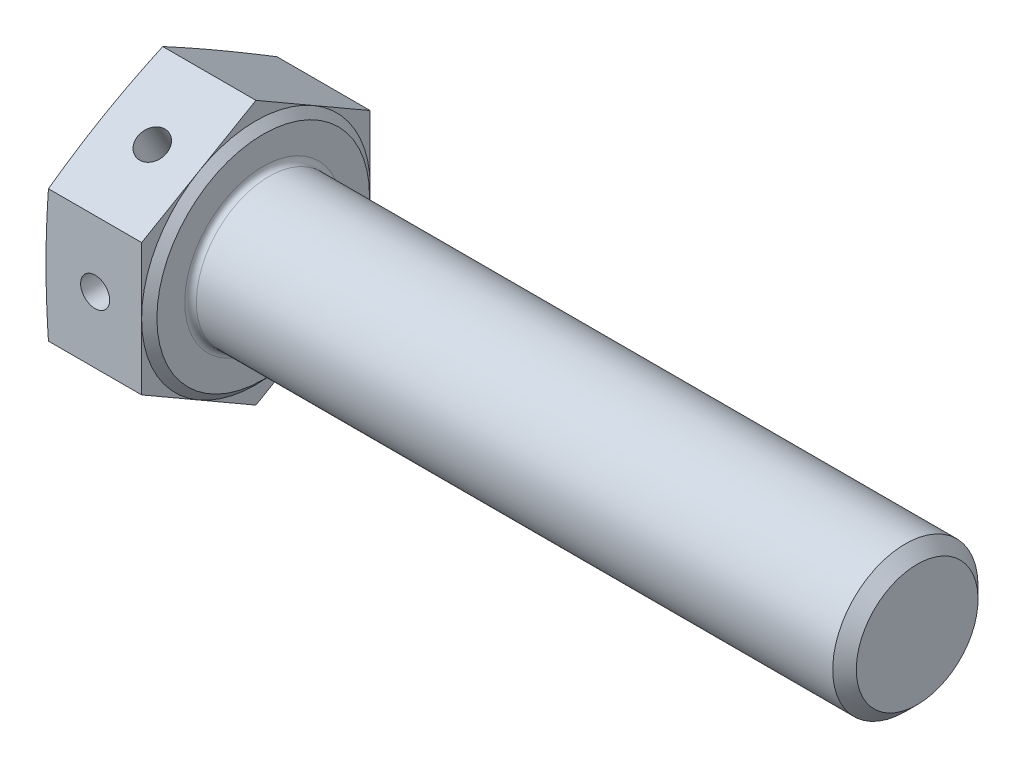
ISO-10303-21;
HEADER;
FILE_DESCRIPTION(('STEP AP214'),'2;1');
FILE_NAME('part.step','',(''),(''),'','','');
FILE_SCHEMA(('AUTOMOTIVE_DESIGN { 1 0 10303 214 1 1 1 1 }'));
ENDSEC;
DATA;
#1=APPLICATION_CONTEXT('core data for automotive mechanical design processes');
#2=APPLICATION_PROTOCOL_DEFINITION('international standard','automotive_design',2000,#1);
#3=PRODUCT_CONTEXT('',#1,'mechanical');
#4=PRODUCT('Part','Part','',(#3));
#5=PRODUCT_RELATED_PRODUCT_CATEGORY('part','',(#4));
#6=PRODUCT_DEFINITION_FORMATION('','',#4);
#7=PRODUCT_DEFINITION_CONTEXT('part definition',#1,'design');
#8=PRODUCT_DEFINITION('design','',#6,#7);
#9=PRODUCT_DEFINITION_SHAPE('','',#8);
#10=(LENGTH_UNIT() NAMED_UNIT(*) SI_UNIT(.MILLI.,.METRE.));
#11=(NAMED_UNIT(*) PLANE_ANGLE_UNIT() SI_UNIT($,.RADIAN.));
#12=(NAMED_UNIT(*) SI_UNIT($,.STERADIAN.) SOLID_ANGLE_UNIT());
#13=UNCERTAINTY_MEASURE_WITH_UNIT(LENGTH_MEASURE(1.E-05),#10,'distance_accuracy_value','');
#14=(GEOMETRIC_REPRESENTATION_CONTEXT(3) GLOBAL_UNCERTAINTY_ASSIGNED_CONTEXT((#13)) GLOBAL_UNIT_ASSIGNED_CONTEXT((#10,
#11,#12)) REPRESENTATION_CONTEXT('',''));
#15=CARTESIAN_POINT('',(0.,0.,0.));
#16=DIRECTION('',(0.,0.,1.));
#17=DIRECTION('',(1.,0.,0.));
#18=AXIS2_PLACEMENT_3D('',#15,#16,#17);
#19=CARTESIAN_POINT('',(3.38,0.,-7.865));
#20=DIRECTION('',(0.,0.,1.));
#21=DIRECTION('',(1.,0.,0.));
#22=AXIS2_PLACEMENT_3D('',#19,#20,#21);
#23=CYLINDRICAL_SURFACE('',#22,0.999999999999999);
#24=CARTESIAN_POINT('',(3.38,0.,7.865));
#25=DIRECTION('',(0.,0.,1.));
#26=DIRECTION('',(1.,0.,0.));
#27=AXIS2_PLACEMENT_3D('',#24,#25,#26);
#28=CIRCLE('',#27,0.999999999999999);
#29=CARTESIAN_POINT('',(4.38,0.,7.865));
#30=VERTEX_POINT('',#29);
#31=EDGE_CURVE('E584',#30,#30,#28,.T.);
#32=ORIENTED_EDGE('',*,*,#31,.T.);
#33=EDGE_LOOP('',(#32));
#34=FACE_BOUND('',#33,.T.);
#35=CARTESIAN_POINT('',(3.38,0.,0.));
#36=DIRECTION('',(0.,-0.866025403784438,0.500000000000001));
#37=DIRECTION('',(0.,0.500000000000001,0.866025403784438));
#38=AXIS2_PLACEMENT_3D('',#35,#36,#37);
#39=ELLIPSE('',#38,1.99999999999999,0.999999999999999);
#40=CARTESIAN_POINT('',(2.38,0.,0.));
#41=VERTEX_POINT('',#40);
#42=CARTESIAN_POINT('',(4.38,0.,0.));
#43=VERTEX_POINT('',#42);
#44=EDGE_CURVE('E46',#41,#43,#39,.F.);
#45=ORIENTED_EDGE('',*,*,#44,.T.);
#46=CARTESIAN_POINT('',(3.38,0.,0.));
#47=DIRECTION('',(0.,0.500000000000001,0.866025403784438));
#48=DIRECTION('',(0.,-0.866025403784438,0.500000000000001));
#49=AXIS2_PLACEMENT_3D('',#46,#47,#48);
#50=ELLIPSE('',#49,1.15470053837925,0.999999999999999);
#51=EDGE_CURVE('E11',#43,#41,#50,.F.);
#52=ORIENTED_EDGE('',*,*,#51,.T.);
#53=EDGE_LOOP('',(#45,#52));
#54=FACE_BOUND('',#53,.T.);
#55=ADVANCED_FACE('F32',(#34,#54),#23,.F.);
#56=CARTESIAN_POINT('',(7.08,0.,0.));
#57=DIRECTION('',(-1.,0.,0.));
#58=DIRECTION('',(0.,-1.,0.));
#59=AXIS2_PLACEMENT_3D('',#56,#57,#58);
#60=PLANE('',#59);
#61=CARTESIAN_POINT('',(7.08,0.,0.));
#62=DIRECTION('',(-1.,0.,0.));
#63=DIRECTION('',(0.,-1.,0.));
#64=AXIS2_PLACEMENT_3D('',#61,#62,#63);
#65=CIRCLE('',#64,5.4);
#66=CARTESIAN_POINT('',(7.08,-5.4,0.));
#67=VERTEX_POINT('',#66);
#68=EDGE_CURVE('E137',#67,#67,#65,.T.);
#69=ORIENTED_EDGE('',*,*,#68,.T.);
#70=EDGE_LOOP('',(#69));
#71=FACE_BOUND('',#70,.T.);
#72=CARTESIAN_POINT('',(7.08,0.,0.));
#73=DIRECTION('',(-1.,0.,0.));
#74=DIRECTION('',(0.,-1.,0.));
#75=AXIS2_PLACEMENT_3D('',#72,#73,#74);
#76=CIRCLE('',#75,7.315);
#77=CARTESIAN_POINT('',(7.08,-7.315,0.));
#78=VERTEX_POINT('',#77);
#79=EDGE_CURVE('E284',#78,#78,#76,.T.);
#80=ORIENTED_EDGE('',*,*,#79,.F.);
#81=EDGE_LOOP('',(#80));
#82=FACE_BOUND('',#81,.T.);
#83=ADVANCED_FACE('F239',(#71,#82),#60,.F.);
#84=CARTESIAN_POINT('',(6.58,-13.6225796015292,-7.865));
#85=DIRECTION('',(1.,0.,0.));
#86=DIRECTION('',(0.,0.,-1.));
#87=AXIS2_PLACEMENT_3D('',#84,#85,#86);
#88=PLANE('',#87);
#89=DIRECTION('',(0.,-0.5,-0.866025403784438));
#90=VECTOR('',#89,1.);
#91=CARTESIAN_POINT('',(6.58,-4.54085986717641,7.865));
#92=LINE('',#91,#90);
#93=CARTESIAN_POINT('',(6.58,-4.54085986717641,7.865));
#94=VERTEX_POINT('',#93);
#95=CARTESIAN_POINT('',(6.58,-6.81128980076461,3.9325));
#96=VERTEX_POINT('',#95);
#97=EDGE_CURVE('E197',#94,#96,#92,.T.);
#98=ORIENTED_EDGE('',*,*,#97,.T.);
#99=CARTESIAN_POINT('',(6.58,0.,0.));
#100=DIRECTION('',(-1.,0.,0.));
#101=DIRECTION('',(0.,-1.,0.));
#102=AXIS2_PLACEMENT_3D('',#99,#100,#101);
#103=CIRCLE('',#102,7.865);
#104=CARTESIAN_POINT('',(6.58,0.,7.865));
#105=VERTEX_POINT('',#104);
#106=EDGE_CURVE('E54',#96,#105,#103,.T.);
#107=ORIENTED_EDGE('',*,*,#106,.T.);
#108=DIRECTION('',(0.,-1.,0.));
#109=VECTOR('',#108,1.);
#110=CARTESIAN_POINT('',(6.58,4.54085986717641,7.865));
#111=LINE('',#110,#109);
#112=EDGE_CURVE('E180',#105,#94,#111,.T.);
#113=ORIENTED_EDGE('',*,*,#112,.T.);
#114=EDGE_LOOP('',(#98,#107,#113));
#115=FACE_BOUND('',#114,.T.);
#116=ADVANCED_FACE('F245',(#115),#88,.T.);
#117=CARTESIAN_POINT('',(6.58,4.54085986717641,7.865));
#118=VERTEX_POINT('',#117);
#119=EDGE_CURVE('E177',#118,#105,#111,.T.);
#120=ORIENTED_EDGE('',*,*,#119,.T.);
#121=CARTESIAN_POINT('',(6.58,6.81128980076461,3.9325));
#122=VERTEX_POINT('',#121);
#123=EDGE_CURVE('E153',#105,#122,#103,.T.);
#124=ORIENTED_EDGE('',*,*,#123,.T.);
#125=DIRECTION('',(0.,-0.5,0.866025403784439));
#126=VECTOR('',#125,1.);
#127=CARTESIAN_POINT('',(6.58,9.08171973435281,0.));
#128=LINE('',#127,#126);
#129=EDGE_CURVE('E184',#122,#118,#128,.T.);
#130=ORIENTED_EDGE('',*,*,#129,.T.);
#131=EDGE_LOOP('',(#120,#124,#130));
#132=FACE_BOUND('',#131,.T.);
#133=ADVANCED_FACE('F341',(#132),#88,.T.);
#134=CARTESIAN_POINT('',(6.58,9.08171973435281,0.));
#135=VERTEX_POINT('',#134);
#136=EDGE_CURVE('E181',#135,#122,#128,.T.);
#137=ORIENTED_EDGE('',*,*,#136,.T.);
#138=CARTESIAN_POINT('',(6.58,6.81128980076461,-3.9325));
#139=VERTEX_POINT('',#138);
#140=EDGE_CURVE('E346',#122,#139,#103,.T.);
#141=ORIENTED_EDGE('',*,*,#140,.T.);
#142=DIRECTION('',(0.,0.5,0.866025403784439));
#143=VECTOR('',#142,1.);
#144=CARTESIAN_POINT('',(6.58,4.54085986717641,-7.865));
#145=LINE('',#144,#143);
#146=EDGE_CURVE('E188',#139,#135,#145,.T.);
#147=ORIENTED_EDGE('',*,*,#146,.T.);
#148=EDGE_LOOP('',(#137,#141,#147));
#149=FACE_BOUND('',#148,.T.);
#150=ADVANCED_FACE('F345',(#149),#88,.T.);
#151=CARTESIAN_POINT('',(6.58,4.54085986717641,-7.865));
#152=VERTEX_POINT('',#151);
#153=EDGE_CURVE('E185',#152,#139,#145,.T.);
#154=ORIENTED_EDGE('',*,*,#153,.T.);
#155=CARTESIAN_POINT('',(6.58,0.,-7.865));
#156=VERTEX_POINT('',#155);
#157=EDGE_CURVE('E405',#139,#156,#103,.T.);
#158=ORIENTED_EDGE('',*,*,#157,.T.);
#159=DIRECTION('',(0.,1.,0.));
#160=VECTOR('',#159,1.);
#161=CARTESIAN_POINT('',(6.58,-4.54085986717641,-7.865));
#162=LINE('',#161,#160);
#163=EDGE_CURVE('E192',#156,#152,#162,.T.);
#164=ORIENTED_EDGE('',*,*,#163,.T.);
#165=EDGE_LOOP('',(#154,#158,#164));
#166=FACE_BOUND('',#165,.T.);
#167=ADVANCED_FACE('F398',(#166),#88,.T.);
#168=CARTESIAN_POINT('',(6.58,-4.54085986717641,-7.865));
#169=VERTEX_POINT('',#168);
#170=EDGE_CURVE('E189',#169,#156,#162,.T.);
#171=ORIENTED_EDGE('',*,*,#170,.T.);
#172=CARTESIAN_POINT('',(6.58,-6.81128980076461,-3.9325));
#173=VERTEX_POINT('',#172);
#174=EDGE_CURVE('E403',#156,#173,#103,.T.);
#175=ORIENTED_EDGE('',*,*,#174,.T.);
#176=DIRECTION('',(0.,0.5,-0.866025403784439));
#177=VECTOR('',#176,1.);
#178=CARTESIAN_POINT('',(6.58,-9.08171973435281,0.));
#179=LINE('',#178,#177);
#180=EDGE_CURVE('E196',#173,#169,#179,.T.);
#181=ORIENTED_EDGE('',*,*,#180,.T.);
#182=EDGE_LOOP('',(#171,#175,#181));
#183=FACE_BOUND('',#182,.T.);
#184=ADVANCED_FACE('F393',(#183),#88,.T.);
#185=CARTESIAN_POINT('',(6.58,-9.08171973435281,0.));
#186=VERTEX_POINT('',#185);
#187=EDGE_CURVE('E193',#186,#173,#179,.T.);
#188=ORIENTED_EDGE('',*,*,#187,.T.);
#189=EDGE_CURVE('E292',#173,#96,#103,.T.);
#190=ORIENTED_EDGE('',*,*,#189,.T.);
#191=EDGE_CURVE('E200',#96,#186,#92,.T.);
#192=ORIENTED_EDGE('',*,*,#191,.T.);
#193=EDGE_LOOP('',(#188,#190,#192));
#194=FACE_BOUND('',#193,.T.);
#195=ADVANCED_FACE('F234',(#194),#88,.T.);
#196=CARTESIAN_POINT('',(6.58,-4.54085986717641,7.865));
#197=DIRECTION('',(0.,0.866025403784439,-0.5));
#198=DIRECTION('',(0.,0.5,0.866025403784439));
#199=AXIS2_PLACEMENT_3D('',#196,#197,#198);
#200=PLANE('',#199);
#201=CARTESIAN_POINT('',(0.168092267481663,-9.08183520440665,-0.000199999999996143));
#202=CARTESIAN_POINT('',(0.141966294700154,-8.89279242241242,0.327231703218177));
#203=CARTESIAN_POINT('',(0.118290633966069,-8.70365739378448,0.654823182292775));
#204=CARTESIAN_POINT('',(0.0767449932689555,-8.32520947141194,1.31031421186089));
#205=CARTESIAN_POINT('',(0.0588756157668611,-8.13589656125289,1.63821379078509));
#206=CARTESIAN_POINT('',(0.029873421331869,-7.7574000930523,2.29378890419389));
#207=CARTESIAN_POINT('',(0.0187313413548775,-7.56821671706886,2.62146412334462));
#208=CARTESIAN_POINT('',(0.00379481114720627,-7.18978549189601,3.27692623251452));
#209=CARTESIAN_POINT('',(0.,-7.00053764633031,3.60471311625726));
#210=CARTESIAN_POINT('',(0.,-6.62204195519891,4.26028688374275));
#211=CARTESIAN_POINT('',(0.0037948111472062,-6.43279410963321,4.58807376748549));
#212=CARTESIAN_POINT('',(0.0187313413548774,-6.05436288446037,5.24353587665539));
#213=CARTESIAN_POINT('',(0.0298734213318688,-5.86517950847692,5.57121109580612));
#214=CARTESIAN_POINT('',(0.0588756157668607,-5.48668304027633,6.22678620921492));
#215=CARTESIAN_POINT('',(0.0767449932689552,-5.29737013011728,6.55468578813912));
#216=CARTESIAN_POINT('',(0.118290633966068,-4.91892220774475,7.21017681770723));
#217=CARTESIAN_POINT('',(0.141966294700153,-4.7297871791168,7.53776829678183));
#218=CARTESIAN_POINT('',(0.168092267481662,-4.54074439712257,7.8652));
#219=B_SPLINE_CURVE_WITH_KNOTS('',3,(#201,#202,#203,#204,#205,#206,#207,#208,#209,#210,#211,
#212,#213,#214,#215,#216,#217,#218),.UNSPECIFIED.,.F.,.F.,(4,2,2,2,2,2,2,2,4),(0.,
1.13697631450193,2.27407056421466,3.40959551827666,4.54506469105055,5.68053386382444,
6.81605881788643,7.95315306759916,9.09012938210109),.UNSPECIFIED.);
#220=CARTESIAN_POINT('',(0.168076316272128,-9.08171973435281,0.));
#221=VERTEX_POINT('',#220);
#222=CARTESIAN_POINT('',(0.,-6.81128980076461,3.9325));
#223=VERTEX_POINT('',#222);
#224=EDGE_CURVE('E356',#221,#223,#219,.T.);
#225=ORIENTED_EDGE('',*,*,#224,.F.);
#226=DIRECTION('',(-1.,0.,0.));
#227=VECTOR('',#226,1.);
#228=CARTESIAN_POINT('',(6.58,-9.08171973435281,0.));
#229=LINE('',#228,#227);
#230=EDGE_CURVE('E158',#186,#221,#229,.T.);
#231=ORIENTED_EDGE('',*,*,#230,.F.);
#232=ORIENTED_EDGE('',*,*,#191,.F.);
#233=ORIENTED_EDGE('',*,*,#97,.F.);
#234=DIRECTION('',(-1.,0.,0.));
#235=VECTOR('',#234,1.);
#236=CARTESIAN_POINT('',(6.58,-4.54085986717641,7.865));
#237=LINE('',#236,#235);
#238=CARTESIAN_POINT('',(0.168076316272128,-4.5408598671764,7.865));
#239=VERTEX_POINT('',#238);
#240=EDGE_CURVE('E174',#94,#239,#237,.T.);
#241=ORIENTED_EDGE('',*,*,#240,.T.);
#242=EDGE_CURVE('E333',#223,#239,#219,.T.);
#243=ORIENTED_EDGE('',*,*,#242,.F.);
#244=EDGE_LOOP('',(#225,#231,#232,#233,#241,#243));
#245=FACE_BOUND('',#244,.T.);
#246=ADVANCED_FACE('F34',(#245),#200,.F.);
#247=CARTESIAN_POINT('',(6.58,-9.08171973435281,0.));
#248=DIRECTION('',(0.,0.866025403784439,0.5));
#249=DIRECTION('',(0.,-0.5,0.866025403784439));
#250=AXIS2_PLACEMENT_3D('',#247,#248,#249);
#251=PLANE('',#250);
#252=CARTESIAN_POINT('',(3.38,-6.81128980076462,-3.93249999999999));
#253=DIRECTION('',(0.,0.866025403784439,0.5));
#254=DIRECTION('',(0.,-0.5,0.866025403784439));
#255=AXIS2_PLACEMENT_3D('',#252,#253,#254);
#256=CIRCLE('',#255,0.999999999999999);
#257=CARTESIAN_POINT('',(3.38,-7.31128980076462,-3.06647459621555));
#258=VERTEX_POINT('',#257);
#259=EDGE_CURVE('E582',#258,#258,#256,.T.);
#260=ORIENTED_EDGE('',*,*,#259,.T.);
#261=EDGE_LOOP('',(#260));
#262=FACE_BOUND('',#261,.T.);
#263=CARTESIAN_POINT('',(0.168092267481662,-4.54074439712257,-7.8652));
#264=CARTESIAN_POINT('',(0.141966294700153,-4.7297871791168,-7.53776829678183));
#265=CARTESIAN_POINT('',(0.118290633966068,-4.91892220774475,-7.21017681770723));
#266=CARTESIAN_POINT('',(0.0767449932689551,-5.29737013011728,-6.55468578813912));
#267=CARTESIAN_POINT('',(0.0588756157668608,-5.48668304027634,-6.22678620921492));
#268=CARTESIAN_POINT('',(0.0298734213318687,-5.86517950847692,-5.57121109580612));
#269=CARTESIAN_POINT('',(0.0187313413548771,-6.05436288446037,-5.24353587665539));
#270=CARTESIAN_POINT('',(0.00379481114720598,-6.43279410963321,-4.58807376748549));
#271=CARTESIAN_POINT('',(0.,-6.62204195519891,-4.26028688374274));
#272=CARTESIAN_POINT('',(0.,-7.00053764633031,-3.60471311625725));
#273=CARTESIAN_POINT('',(0.00379481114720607,-7.18978549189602,-3.27692623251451));
#274=CARTESIAN_POINT('',(0.0187313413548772,-7.56821671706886,-2.62146412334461));
#275=CARTESIAN_POINT('',(0.0298734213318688,-7.7574000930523,-2.29378890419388));
#276=CARTESIAN_POINT('',(0.058875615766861,-8.13589656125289,-1.63821379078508));
#277=CARTESIAN_POINT('',(0.0767449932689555,-8.32520947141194,-1.31031421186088));
#278=CARTESIAN_POINT('',(0.118290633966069,-8.70365739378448,-0.654823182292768));
#279=CARTESIAN_POINT('',(0.141966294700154,-8.89279242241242,-0.327231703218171));
#280=CARTESIAN_POINT('',(0.168092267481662,-9.08183520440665,0.000200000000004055));
#281=B_SPLINE_CURVE_WITH_KNOTS('',3,(#263,#264,#265,#266,#267,#268,#269,#270,#271,#272,#273,
#274,#275,#276,#277,#278,#279,#280),.UNSPECIFIED.,.F.,.F.,(4,2,2,2,2,2,2,2,4),(0.,
1.13697631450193,2.27407056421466,3.40959551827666,4.54506469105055,5.68053386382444,
6.81605881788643,7.95315306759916,9.09012938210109),.UNSPECIFIED.);
#282=CARTESIAN_POINT('',(0.168076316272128,-4.5408598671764,-7.865));
#283=VERTEX_POINT('',#282);
#284=CARTESIAN_POINT('',(0.,-6.81128980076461,-3.9325));
#285=VERTEX_POINT('',#284);
#286=EDGE_CURVE('E355',#283,#285,#281,.T.);
#287=ORIENTED_EDGE('',*,*,#286,.F.);
#288=DIRECTION('',(-1.,0.,0.));
#289=VECTOR('',#288,1.);
#290=CARTESIAN_POINT('',(6.58,-4.54085986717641,-7.865));
#291=LINE('',#290,#289);
#292=EDGE_CURVE('E162',#169,#283,#291,.T.);
#293=ORIENTED_EDGE('',*,*,#292,.F.);
#294=ORIENTED_EDGE('',*,*,#180,.F.);
#295=ORIENTED_EDGE('',*,*,#187,.F.);
#296=ORIENTED_EDGE('',*,*,#230,.T.);
#297=EDGE_CURVE('E210',#285,#221,#281,.T.);
#298=ORIENTED_EDGE('',*,*,#297,.F.);
#299=EDGE_LOOP('',(#287,#293,#294,#295,#296,#298));
#300=FACE_BOUND('',#299,.T.);
#301=ADVANCED_FACE('F224',(#262,#300),#251,.F.);
#302=CARTESIAN_POINT('',(6.58,-4.54085986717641,-7.865));
#303=DIRECTION('',(0.,0.,1.));
#304=DIRECTION('',(1.,0.,0.));
#305=AXIS2_PLACEMENT_3D('',#302,#303,#304);
#306=PLANE('',#305);
#307=CARTESIAN_POINT('',(3.38,0.,-7.865));
#308=DIRECTION('',(0.,0.,1.));
#309=DIRECTION('',(1.,0.,0.));
#310=AXIS2_PLACEMENT_3D('',#307,#308,#309);
#311=CIRCLE('',#310,0.999999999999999);
#312=CARTESIAN_POINT('',(4.38,0.,-7.865));
#313=VERTEX_POINT('',#312);
#314=EDGE_CURVE('E290',#313,#313,#311,.T.);
#315=ORIENTED_EDGE('',*,*,#314,.T.);
#316=EDGE_LOOP('',(#315));
#317=FACE_BOUND('',#316,.T.);
#318=CARTESIAN_POINT('',(0.893795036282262,-11.9850555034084,-7.865));
#319=CARTESIAN_POINT('',(0.852573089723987,-11.6280375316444,-7.865));
#320=CARTESIAN_POINT('',(0.81187810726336,-11.2709576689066,-7.865));
#321=CARTESIAN_POINT('',(0.731819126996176,-10.5566446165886,-7.865));
#322=CARTESIAN_POINT('',(0.692455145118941,-10.1994114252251,-7.865));
#323=CARTESIAN_POINT('',(0.615326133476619,-9.48467722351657,-7.865));
#324=CARTESIAN_POINT('',(0.577561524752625,-9.12717616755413,-7.865));
#325=CARTESIAN_POINT('',(0.504010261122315,-8.41197109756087,-7.865));
#326=CARTESIAN_POINT('',(0.468223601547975,-8.05426708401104,-7.865));
#327=CARTESIAN_POINT('',(0.399151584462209,-7.33935256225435,-7.865));
#328=CARTESIAN_POINT('',(0.365861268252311,-6.98214253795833,-7.865));
#329=CARTESIAN_POINT('',(0.302260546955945,-6.26745790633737,-7.865));
#330=CARTESIAN_POINT('',(0.271950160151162,-5.90998329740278,-7.865));
#331=CARTESIAN_POINT('',(0.186471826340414,-4.83714018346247,-7.865));
#332=CARTESIAN_POINT('',(0.136752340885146,-4.12130881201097,-7.865));
#333=CARTESIAN_POINT('',(0.0777307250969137,-3.04568224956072,-7.865));
#334=CARTESIAN_POINT('',(0.060636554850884,-2.68631246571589,-7.865));
#335=CARTESIAN_POINT('',(0.0324610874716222,-1.96733372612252,-7.865));
#336=CARTESIAN_POINT('',(0.0213797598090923,-1.60772477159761,-7.865));
#337=CARTESIAN_POINT('',(0.00580851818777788,-0.88840120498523,-7.865));
#338=CARTESIAN_POINT('',(0.00131788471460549,-0.528686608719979,-7.865));
#339=CARTESIAN_POINT('',(-0.000816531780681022,0.19076325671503,-7.865));
#340=CARTESIAN_POINT('',(0.00153968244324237,0.550498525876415,-7.865));
#341=CARTESIAN_POINT('',(0.012967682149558,1.27020540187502,-7.865));
#342=CARTESIAN_POINT('',(0.022045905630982,1.6301769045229,-7.865));
#343=CARTESIAN_POINT('',(0.0464322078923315,2.34990682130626,-7.865));
#344=CARTESIAN_POINT('',(0.061740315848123,2.70966523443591,-7.865));
#345=CARTESIAN_POINT('',(0.097860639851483,3.42895669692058,-7.865));
#346=CARTESIAN_POINT('',(0.118673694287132,3.78848970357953,-7.865));
#347=CARTESIAN_POINT('',(0.164991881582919,4.50724972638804,-7.865));
#348=CARTESIAN_POINT('',(0.190497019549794,4.86647674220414,-7.865));
#349=CARTESIAN_POINT('',(0.269985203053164,5.90645748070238,-7.865));
#350=CARTESIAN_POINT('',(0.329004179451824,6.58682474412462,-7.865));
#351=CARTESIAN_POINT('',(0.456487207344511,7.94667408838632,-7.865));
#352=CARTESIAN_POINT('',(0.524951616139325,8.6261561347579,-7.865));
#353=CARTESIAN_POINT('',(0.668265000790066,9.98451152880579,-7.865));
#354=CARTESIAN_POINT('',(0.743114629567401,10.6633848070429,-7.865));
#355=CARTESIAN_POINT('',(0.897186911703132,12.0206191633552,-7.865));
#356=CARTESIAN_POINT('',(0.976409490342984,12.6989802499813,-7.865));
#357=CARTESIAN_POINT('',(1.13771864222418,14.0535702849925,-7.865));
#358=CARTESIAN_POINT('',(1.21979722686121,14.7298001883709,-7.865));
#359=CARTESIAN_POINT('',(1.38616373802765,16.0819910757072,-7.865));
#360=CARTESIAN_POINT('',(1.47045167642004,16.7579520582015,-7.865));
#361=CARTESIAN_POINT('',(1.64062116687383,18.1093972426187,-7.865));
#362=CARTESIAN_POINT('',(1.72650206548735,18.7848815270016,-7.865));
#363=CARTESIAN_POINT('',(1.89951689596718,20.1356829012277,-7.865));
#364=CARTESIAN_POINT('',(1.98665081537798,20.810999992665,-7.865));
#365=CARTESIAN_POINT('',(2.07422538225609,21.4862592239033,-7.865));
#366=B_SPLINE_CURVE_WITH_KNOTS('',3,(#318,#319,#320,#321,#322,#323,#324,#325,#326,#327,#328,
#329,#330,#331,#332,#333,#334,#335,#336,#337,#338,#339,#340,#341,#342,#343,#344,#345,#346,#347,
#348,#349,#350,#351,#352,#353,#354,#355,#356,#357,#358,#359,#360,#361,#362,#363,#364,#365),
.UNSPECIFIED.,.F.,.F.,(4,2,2,2,2,2,2,2,2,2,2,2,2,2,2,2,2,2,2,2,2,2,2,4),(0.,1.07817076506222,
2.15635442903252,3.23482018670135,4.3132833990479,5.38954426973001,6.46581174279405,
8.61821531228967,9.69750286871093,10.7767849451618,11.8559491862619,12.9351129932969,
14.0153117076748,15.0955154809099,16.175883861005,17.2562534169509,19.3049062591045,
21.3536366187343,23.4025767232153,25.451481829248,27.4950556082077,29.5386403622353,
31.5814045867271,33.6241485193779),.UNSPECIFIED.);
#367=CARTESIAN_POINT('',(0.168076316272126,4.54085986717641,-7.865));
#368=VERTEX_POINT('',#367);
#369=CARTESIAN_POINT('',(0.,0.,-7.865));
#370=VERTEX_POINT('',#369);
#371=EDGE_CURVE('E208',#368,#370,#366,.F.);
#372=ORIENTED_EDGE('',*,*,#371,.F.);
#373=DIRECTION('',(-1.,0.,0.));
#374=VECTOR('',#373,1.);
#375=CARTESIAN_POINT('',(6.58,4.54085986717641,-7.865));
#376=LINE('',#375,#374);
#377=EDGE_CURVE('E165',#152,#368,#376,.T.);
#378=ORIENTED_EDGE('',*,*,#377,.F.);
#379=ORIENTED_EDGE('',*,*,#163,.F.);
#380=ORIENTED_EDGE('',*,*,#170,.F.);
#381=ORIENTED_EDGE('',*,*,#292,.T.);
#382=EDGE_CURVE('E201',#370,#283,#366,.F.);
#383=ORIENTED_EDGE('',*,*,#382,.F.);
#384=EDGE_LOOP('',(#372,#378,#379,#380,#381,#383));
#385=FACE_BOUND('',#384,.T.);
#386=ADVANCED_FACE('F219',(#317,#385),#306,.F.);
#387=CARTESIAN_POINT('',(6.58,4.54085986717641,-7.865));
#388=DIRECTION('',(0.,-0.866025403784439,0.5));
#389=DIRECTION('',(0.,-0.5,-0.866025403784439));
#390=AXIS2_PLACEMENT_3D('',#387,#388,#389);
#391=PLANE('',#390);
#392=CARTESIAN_POINT('',(0.168092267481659,9.08183520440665,0.000199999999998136));
#393=CARTESIAN_POINT('',(0.141966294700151,8.89279242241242,-0.327231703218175));
#394=CARTESIAN_POINT('',(0.118290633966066,8.70365739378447,-0.654823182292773));
#395=CARTESIAN_POINT('',(0.076744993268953,8.32520947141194,-1.31031421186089));
#396=CARTESIAN_POINT('',(0.0588756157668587,8.13589656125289,-1.63821379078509));
#397=CARTESIAN_POINT('',(0.0298734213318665,7.7574000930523,-2.29378890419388));
#398=CARTESIAN_POINT('',(0.0187313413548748,7.56821671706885,-2.62146412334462));
#399=CARTESIAN_POINT('',(0.00379481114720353,7.18978549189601,-3.27692623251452));
#400=CARTESIAN_POINT('',(0.,7.00053764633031,-3.60471311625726));
#401=CARTESIAN_POINT('',(0.,6.62204195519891,-4.26028688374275));
#402=CARTESIAN_POINT('',(0.00379481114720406,6.43279410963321,-4.58807376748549));
#403=CARTESIAN_POINT('',(0.0187313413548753,6.05436288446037,-5.24353587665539));
#404=CARTESIAN_POINT('',(0.0298734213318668,5.86517950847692,-5.57121109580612));
#405=CARTESIAN_POINT('',(0.0588756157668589,5.48668304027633,-6.22678620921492));
#406=CARTESIAN_POINT('',(0.0767449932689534,5.29737013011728,-6.55468578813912));
#407=CARTESIAN_POINT('',(0.118290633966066,4.91892220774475,-7.21017681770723));
#408=CARTESIAN_POINT('',(0.141966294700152,4.7297871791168,-7.53776829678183));
#409=CARTESIAN_POINT('',(0.16809226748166,4.54074439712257,-7.8652));
#410=B_SPLINE_CURVE_WITH_KNOTS('',3,(#392,#393,#394,#395,#396,#397,#398,#399,#400,#401,#402,
#403,#404,#405,#406,#407,#408,#409),.UNSPECIFIED.,.F.,.F.,(4,2,2,2,2,2,2,2,4),(0.,
1.13697631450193,2.27407056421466,3.40959551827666,4.54506469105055,5.68053386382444,
6.81605881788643,7.95315306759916,9.09012938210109),.UNSPECIFIED.);
#411=CARTESIAN_POINT('',(0.168076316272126,9.08171973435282,0.));
#412=VERTEX_POINT('',#411);
#413=CARTESIAN_POINT('',(0.,6.81128980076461,-3.9325));
#414=VERTEX_POINT('',#413);
#415=EDGE_CURVE('E352',#412,#414,#410,.T.);
#416=ORIENTED_EDGE('',*,*,#415,.F.);
#417=DIRECTION('',(-1.,0.,0.));
#418=VECTOR('',#417,1.);
#419=CARTESIAN_POINT('',(6.58,9.08171973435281,0.));
#420=LINE('',#419,#418);
#421=EDGE_CURVE('E168',#135,#412,#420,.T.);
#422=ORIENTED_EDGE('',*,*,#421,.F.);
#423=ORIENTED_EDGE('',*,*,#146,.F.);
#424=ORIENTED_EDGE('',*,*,#153,.F.);
#425=ORIENTED_EDGE('',*,*,#377,.T.);
#426=EDGE_CURVE('E209',#414,#368,#410,.T.);
#427=ORIENTED_EDGE('',*,*,#426,.F.);
#428=EDGE_LOOP('',(#416,#422,#423,#424,#425,#427));
#429=FACE_BOUND('',#428,.T.);
#430=ADVANCED_FACE('F223',(#429),#391,.F.);
#431=CARTESIAN_POINT('',(6.58,9.08171973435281,0.));
#432=DIRECTION('',(0.,-0.866025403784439,-0.5));
#433=DIRECTION('',(0.,0.5,-0.866025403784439));
#434=AXIS2_PLACEMENT_3D('',#431,#432,#433);
#435=PLANE('',#434);
#436=CARTESIAN_POINT('',(3.38,6.81128980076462,3.93249999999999));
#437=DIRECTION('',(0.,-0.866025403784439,-0.5));
#438=DIRECTION('',(0.,0.5,-0.866025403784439));
#439=AXIS2_PLACEMENT_3D('',#436,#437,#438);
#440=CIRCLE('',#439,0.999999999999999);
#441=CARTESIAN_POINT('',(3.38,7.31128980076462,3.06647459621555));
#442=VERTEX_POINT('',#441);
#443=EDGE_CURVE('E323',#442,#442,#440,.T.);
#444=ORIENTED_EDGE('',*,*,#443,.T.);
#445=EDGE_LOOP('',(#444));
#446=FACE_BOUND('',#445,.T.);
#447=CARTESIAN_POINT('',(0.16809226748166,4.54074439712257,7.8652));
#448=CARTESIAN_POINT('',(0.141966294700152,4.7297871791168,7.53776829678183));
#449=CARTESIAN_POINT('',(0.118290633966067,4.91892220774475,7.21017681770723));
#450=CARTESIAN_POINT('',(0.0767449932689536,5.29737013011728,6.55468578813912));
#451=CARTESIAN_POINT('',(0.058875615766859,5.48668304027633,6.22678620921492));
#452=CARTESIAN_POINT('',(0.0298734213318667,5.86517950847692,5.57121109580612));
#453=CARTESIAN_POINT('',(0.0187313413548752,6.05436288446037,5.24353587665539));
#454=CARTESIAN_POINT('',(0.00379481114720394,6.43279410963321,4.58807376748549));
#455=CARTESIAN_POINT('',(0.,6.62204195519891,4.26028688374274));
#456=CARTESIAN_POINT('',(0.,7.00053764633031,3.60471311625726));
#457=CARTESIAN_POINT('',(0.00379481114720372,7.18978549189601,3.27692623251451));
#458=CARTESIAN_POINT('',(0.0187313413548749,7.56821671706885,2.62146412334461));
#459=CARTESIAN_POINT('',(0.0298734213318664,7.7574000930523,2.29378890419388));
#460=CARTESIAN_POINT('',(0.0588756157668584,8.13589656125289,1.63821379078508));
#461=CARTESIAN_POINT('',(0.0767449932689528,8.32520947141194,1.31031421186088));
#462=CARTESIAN_POINT('',(0.118290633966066,8.70365739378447,0.654823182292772));
#463=CARTESIAN_POINT('',(0.141966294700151,8.89279242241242,0.327231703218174));
#464=CARTESIAN_POINT('',(0.168092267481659,9.08183520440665,-0.000199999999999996));
#465=B_SPLINE_CURVE_WITH_KNOTS('',3,(#447,#448,#449,#450,#451,#452,#453,#454,#455,#456,#457,
#458,#459,#460,#461,#462,#463,#464),.UNSPECIFIED.,.F.,.F.,(4,2,2,2,2,2,2,2,4),(0.,
1.13697631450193,2.27407056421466,3.40959551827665,4.54506469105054,5.68053386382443,
6.81605881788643,7.95315306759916,9.09012938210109),.UNSPECIFIED.);
#466=CARTESIAN_POINT('',(0.168076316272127,4.54085986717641,7.865));
#467=VERTEX_POINT('',#466);
#468=CARTESIAN_POINT('',(0.,6.81128980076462,3.93249999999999));
#469=VERTEX_POINT('',#468);
#470=EDGE_CURVE('E301',#467,#469,#465,.T.);
#471=ORIENTED_EDGE('',*,*,#470,.F.);
#472=DIRECTION('',(-1.,0.,0.));
#473=VECTOR('',#472,1.);
#474=CARTESIAN_POINT('',(6.58,4.54085986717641,7.865));
#475=LINE('',#474,#473);
#476=EDGE_CURVE('E171',#118,#467,#475,.T.);
#477=ORIENTED_EDGE('',*,*,#476,.F.);
#478=ORIENTED_EDGE('',*,*,#129,.F.);
#479=ORIENTED_EDGE('',*,*,#136,.F.);
#480=ORIENTED_EDGE('',*,*,#421,.T.);
#481=EDGE_CURVE('E329',#469,#412,#465,.T.);
#482=ORIENTED_EDGE('',*,*,#481,.F.);
#483=EDGE_LOOP('',(#471,#477,#478,#479,#480,#482));
#484=FACE_BOUND('',#483,.T.);
#485=ADVANCED_FACE('F311',(#446,#484),#435,.F.);
#486=CARTESIAN_POINT('',(6.58,4.54085986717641,7.865));
#487=DIRECTION('',(0.,0.,-1.));
#488=DIRECTION('',(-1.,0.,0.));
#489=AXIS2_PLACEMENT_3D('',#486,#487,#488);
#490=PLANE('',#489);
#491=ORIENTED_EDGE('',*,*,#31,.F.);
#492=EDGE_LOOP('',(#491));
#493=FACE_BOUND('',#492,.T.);
#494=CARTESIAN_POINT('',(0.893795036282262,-11.9850555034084,7.865));
#495=CARTESIAN_POINT('',(0.852573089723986,-11.6280375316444,7.865));
#496=CARTESIAN_POINT('',(0.81187810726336,-11.2709576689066,7.865));
#497=CARTESIAN_POINT('',(0.731819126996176,-10.5566446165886,7.865));
#498=CARTESIAN_POINT('',(0.692455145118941,-10.1994114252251,7.865));
#499=CARTESIAN_POINT('',(0.615326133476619,-9.48467722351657,7.865));
#500=CARTESIAN_POINT('',(0.577561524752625,-9.12717616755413,7.865));
#501=CARTESIAN_POINT('',(0.504010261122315,-8.41197109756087,7.865));
#502=CARTESIAN_POINT('',(0.468223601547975,-8.05426708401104,7.865));
#503=CARTESIAN_POINT('',(0.399151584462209,-7.33935256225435,7.865));
#504=CARTESIAN_POINT('',(0.365861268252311,-6.98214253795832,7.865));
#505=CARTESIAN_POINT('',(0.302260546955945,-6.26745790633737,7.865));
#506=CARTESIAN_POINT('',(0.271950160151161,-5.90998329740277,7.865));
#507=CARTESIAN_POINT('',(0.186471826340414,-4.83714018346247,7.865));
#508=CARTESIAN_POINT('',(0.136752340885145,-4.12130881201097,7.865));
#509=CARTESIAN_POINT('',(0.0777307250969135,-3.04568224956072,7.865));
#510=CARTESIAN_POINT('',(0.060636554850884,-2.68631246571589,7.865));
#511=CARTESIAN_POINT('',(0.0324610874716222,-1.96733372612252,7.865));
#512=CARTESIAN_POINT('',(0.0213797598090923,-1.60772477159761,7.865));
#513=CARTESIAN_POINT('',(0.00580851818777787,-0.88840120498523,7.865));
#514=CARTESIAN_POINT('',(0.00131788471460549,-0.528686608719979,7.865));
#515=CARTESIAN_POINT('',(-0.00081653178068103,0.190763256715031,7.865));
#516=CARTESIAN_POINT('',(0.00153968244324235,0.550498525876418,7.865));
#517=CARTESIAN_POINT('',(0.012967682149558,1.27020540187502,7.865));
#518=CARTESIAN_POINT('',(0.022045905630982,1.6301769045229,7.865));
#519=CARTESIAN_POINT('',(0.0464322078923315,2.34990682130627,7.865));
#520=CARTESIAN_POINT('',(0.061740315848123,2.70966523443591,7.865));
#521=CARTESIAN_POINT('',(0.0978606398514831,3.42895669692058,7.865));
#522=CARTESIAN_POINT('',(0.118673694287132,3.78848970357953,7.865));
#523=CARTESIAN_POINT('',(0.164991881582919,4.50724972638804,7.865));
#524=CARTESIAN_POINT('',(0.190497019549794,4.86647674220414,7.865));
#525=CARTESIAN_POINT('',(0.269985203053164,5.90645748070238,7.865));
#526=CARTESIAN_POINT('',(0.329004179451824,6.58682474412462,7.865));
#527=CARTESIAN_POINT('',(0.456487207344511,7.94667408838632,7.865));
#528=CARTESIAN_POINT('',(0.524951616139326,8.62615613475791,7.865));
#529=CARTESIAN_POINT('',(0.668265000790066,9.9845115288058,7.865));
#530=CARTESIAN_POINT('',(0.743114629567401,10.6633848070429,7.865));
#531=CARTESIAN_POINT('',(0.897186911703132,12.0206191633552,7.865));
#532=CARTESIAN_POINT('',(0.976409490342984,12.6989802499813,7.865));
#533=CARTESIAN_POINT('',(1.13771864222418,14.0535702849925,7.865));
#534=CARTESIAN_POINT('',(1.21979722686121,14.7298001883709,7.865));
#535=CARTESIAN_POINT('',(1.38616373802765,16.0819910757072,7.865));
#536=CARTESIAN_POINT('',(1.47045167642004,16.7579520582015,7.865));
#537=CARTESIAN_POINT('',(1.64062116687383,18.1093972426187,7.865));
#538=CARTESIAN_POINT('',(1.72650206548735,18.7848815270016,7.865));
#539=CARTESIAN_POINT('',(1.89951689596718,20.1356829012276,7.865));
#540=CARTESIAN_POINT('',(1.98665081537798,20.810999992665,7.865));
#541=CARTESIAN_POINT('',(2.07422538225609,21.4862592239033,7.865));
#542=B_SPLINE_CURVE_WITH_KNOTS('',3,(#494,#495,#496,#497,#498,#499,#500,#501,#502,#503,#504,
#505,#506,#507,#508,#509,#510,#511,#512,#513,#514,#515,#516,#517,#518,#519,#520,#521,#522,#523,
#524,#525,#526,#527,#528,#529,#530,#531,#532,#533,#534,#535,#536,#537,#538,#539,#540,#541),
.UNSPECIFIED.,.F.,.F.,(4,2,2,2,2,2,2,2,2,2,2,2,2,2,2,2,2,2,2,2,2,2,2,4),(0.,1.07817076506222,
2.15635442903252,3.23482018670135,4.3132833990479,5.38954426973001,6.46581174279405,
8.61821531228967,9.69750286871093,10.7767849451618,11.8559491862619,12.9351129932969,
14.0153117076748,15.0955154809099,16.175883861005,17.2562534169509,19.3049062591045,
21.3536366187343,23.4025767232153,25.451481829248,27.4950556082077,29.5386403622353,
31.5814045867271,33.6241485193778),.UNSPECIFIED.);
#543=CARTESIAN_POINT('',(0.,0.,7.865));
#544=VERTEX_POINT('',#543);
#545=EDGE_CURVE('E300',#239,#544,#542,.T.);
#546=ORIENTED_EDGE('',*,*,#545,.F.);
#547=ORIENTED_EDGE('',*,*,#240,.F.);
#548=ORIENTED_EDGE('',*,*,#112,.F.);
#549=ORIENTED_EDGE('',*,*,#119,.F.);
#550=ORIENTED_EDGE('',*,*,#476,.T.);
#551=EDGE_CURVE('E288',#544,#467,#542,.T.);
#552=ORIENTED_EDGE('',*,*,#551,.F.);
#553=EDGE_LOOP('',(#546,#547,#548,#549,#550,#552));
#554=FACE_BOUND('',#553,.T.);
#555=ADVANCED_FACE('F306',(#493,#554),#490,.F.);
#556=CARTESIAN_POINT('',(0.,0.,0.));
#557=DIRECTION('',(1.,0.,0.));
#558=DIRECTION('',(0.,1.,0.));
#559=AXIS2_PLACEMENT_3D('',#556,#557,#558);
#560=CONICAL_SURFACE('',#559,7.865,1.43352618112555);
#561=ORIENTED_EDGE('',*,*,#382,.T.);
#562=ORIENTED_EDGE('',*,*,#286,.T.);
#563=CARTESIAN_POINT('',(0.,0.,0.));
#564=DIRECTION('',(1.,0.,0.));
#565=DIRECTION('',(0.,0.,-1.));
#566=AXIS2_PLACEMENT_3D('',#563,#564,#565);
#567=CIRCLE('',#566,7.865);
#568=EDGE_CURVE('E154',#285,#370,#567,.T.);
#569=ORIENTED_EDGE('',*,*,#568,.T.);
#570=EDGE_LOOP('',(#561,#562,#569));
#571=FACE_BOUND('',#570,.T.);
#572=ADVANCED_FACE('F310',(#571),#560,.T.);
#573=ORIENTED_EDGE('',*,*,#297,.T.);
#574=ORIENTED_EDGE('',*,*,#224,.T.);
#575=EDGE_CURVE('E157',#223,#285,#567,.T.);
#576=ORIENTED_EDGE('',*,*,#575,.T.);
#577=EDGE_LOOP('',(#573,#574,#576));
#578=FACE_BOUND('',#577,.T.);
#579=ADVANCED_FACE('F377',(#578),#560,.T.);
#580=ORIENTED_EDGE('',*,*,#242,.T.);
#581=ORIENTED_EDGE('',*,*,#545,.T.);
#582=CARTESIAN_POINT('',(0.,0.,0.));
#583=DIRECTION('',(-1.,0.,0.));
#584=DIRECTION('',(0.,-1.,0.));
#585=AXIS2_PLACEMENT_3D('',#582,#583,#584);
#586=CIRCLE('',#585,7.865);
#587=EDGE_CURVE('E286',#223,#544,#586,.T.);
#588=ORIENTED_EDGE('',*,*,#587,.F.);
#589=EDGE_LOOP('',(#580,#581,#588));
#590=FACE_BOUND('',#589,.T.);
#591=ADVANCED_FACE('F385',(#590),#560,.T.);
#592=ORIENTED_EDGE('',*,*,#470,.T.);
#593=EDGE_CURVE('E407',#469,#544,#567,.T.);
#594=ORIENTED_EDGE('',*,*,#593,.T.);
#595=ORIENTED_EDGE('',*,*,#551,.T.);
#596=EDGE_LOOP('',(#592,#594,#595));
#597=FACE_BOUND('',#596,.T.);
#598=ADVANCED_FACE('F409',(#597),#560,.T.);
#599=ORIENTED_EDGE('',*,*,#415,.T.);
#600=EDGE_CURVE('E406',#414,#469,#567,.T.);
#601=ORIENTED_EDGE('',*,*,#600,.T.);
#602=ORIENTED_EDGE('',*,*,#481,.T.);
#603=EDGE_LOOP('',(#599,#601,#602));
#604=FACE_BOUND('',#603,.T.);
#605=ADVANCED_FACE('F411',(#604),#560,.T.);
#606=ORIENTED_EDGE('',*,*,#371,.T.);
#607=EDGE_CURVE('E159',#370,#414,#567,.T.);
#608=ORIENTED_EDGE('',*,*,#607,.T.);
#609=ORIENTED_EDGE('',*,*,#426,.T.);
#610=EDGE_LOOP('',(#606,#608,#609));
#611=FACE_BOUND('',#610,.T.);
#612=ADVANCED_FACE('F215',(#611),#560,.T.);
#613=CARTESIAN_POINT('',(0.,-13.6225796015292,-7.865));
#614=DIRECTION('',(1.,0.,0.));
#615=DIRECTION('',(0.,0.,-1.));
#616=AXIS2_PLACEMENT_3D('',#613,#614,#615);
#617=PLANE('',#616);
#618=ORIENTED_EDGE('',*,*,#607,.F.);
#619=ORIENTED_EDGE('',*,*,#568,.F.);
#620=ORIENTED_EDGE('',*,*,#575,.F.);
#621=ORIENTED_EDGE('',*,*,#587,.T.);
#622=ORIENTED_EDGE('',*,*,#593,.F.);
#623=ORIENTED_EDGE('',*,*,#600,.F.);
#624=EDGE_LOOP('',(#618,#619,#620,#621,#622,#623));
#625=FACE_BOUND('',#624,.T.);
#626=ADVANCED_FACE('F276',(#625),#617,.F.);
#627=CARTESIAN_POINT('',(7.08,0.,0.));
#628=DIRECTION('',(-1.,0.,0.));
#629=DIRECTION('',(0.,-1.,0.));
#630=AXIS2_PLACEMENT_3D('',#627,#628,#629);
#631=CONICAL_SURFACE('',#630,7.315,0.832981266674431);
#632=ORIENTED_EDGE('',*,*,#106,.F.);
#633=ORIENTED_EDGE('',*,*,#189,.F.);
#634=ORIENTED_EDGE('',*,*,#174,.F.);
#635=ORIENTED_EDGE('',*,*,#157,.F.);
#636=ORIENTED_EDGE('',*,*,#140,.F.);
#637=ORIENTED_EDGE('',*,*,#123,.F.);
#638=EDGE_LOOP('',(#632,#633,#634,#635,#636,#637));
#639=FACE_BOUND('',#638,.T.);
#640=ORIENTED_EDGE('',*,*,#79,.T.);
#641=EDGE_LOOP('',(#640));
#642=FACE_BOUND('',#641,.T.);
#643=ADVANCED_FACE('F273',(#639,#642),#631,.T.);
#644=CARTESIAN_POINT('',(52.08,0.,0.));
#645=DIRECTION('',(-1.,0.,0.));
#646=DIRECTION('',(0.,-1.,0.));
#647=AXIS2_PLACEMENT_3D('',#644,#645,#646);
#648=CYLINDRICAL_SURFACE('',#647,5.);
#649=CARTESIAN_POINT('',(7.48,0.,0.));
#650=DIRECTION('',(-1.,0.,0.));
#651=DIRECTION('',(0.,-1.,0.));
#652=AXIS2_PLACEMENT_3D('',#649,#650,#651);
#653=CIRCLE('',#652,5.);
#654=CARTESIAN_POINT('',(7.48000000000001,-5.,0.));
#655=VERTEX_POINT('',#654);
#656=EDGE_CURVE('E144',#655,#655,#653,.F.);
#657=CARTESIAN_POINT('',(51.268,0.,0.));
#658=DIRECTION('',(1.,0.,0.));
#659=DIRECTION('',(0.,1.,0.));
#660=AXIS2_PLACEMENT_3D('',#657,#658,#659);
#661=CIRCLE('',#660,5.);
#662=CARTESIAN_POINT('',(51.268,-4.99999999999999,0.));
#663=VERTEX_POINT('',#662);
#664=EDGE_CURVE('E147',#663,#663,#661,.F.);
#665=CARTESIAN_POINT('',(7.48000000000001,-5.,0.));
#666=CARTESIAN_POINT('',(7.93612500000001,-5.,0.));
#667=CARTESIAN_POINT('',(8.39225000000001,-5.,0.));
#668=CARTESIAN_POINT('',(9.30450000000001,-5.,0.));
#669=CARTESIAN_POINT('',(9.76062500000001,-5.,0.));
#670=CARTESIAN_POINT('',(10.672875,-5.,0.));
#671=CARTESIAN_POINT('',(11.129,-5.,0.));
#672=CARTESIAN_POINT('',(12.04125,-5.,0.));
#673=CARTESIAN_POINT('',(12.497375,-5.,0.));
#674=CARTESIAN_POINT('',(13.409625,-5.,0.));
#675=CARTESIAN_POINT('',(13.86575,-5.,0.));
#676=CARTESIAN_POINT('',(14.778,-5.,0.));
#677=CARTESIAN_POINT('',(15.234125,-5.,0.));
#678=CARTESIAN_POINT('',(16.146375,-5.,0.));
#679=CARTESIAN_POINT('',(16.6025,-5.,0.));
#680=CARTESIAN_POINT('',(17.51475,-5.,0.));
#681=CARTESIAN_POINT('',(17.970875,-5.,0.));
#682=CARTESIAN_POINT('',(18.883125,-5.,0.));
#683=CARTESIAN_POINT('',(19.33925,-5.,0.));
#684=CARTESIAN_POINT('',(20.2515,-5.,0.));
#685=CARTESIAN_POINT('',(20.707625,-5.,0.));
#686=CARTESIAN_POINT('',(21.619875,-5.,0.));
#687=CARTESIAN_POINT('',(22.076,-5.,0.));
#688=CARTESIAN_POINT('',(22.98825,-5.,0.));
#689=CARTESIAN_POINT('',(23.444375,-5.,0.));
#690=CARTESIAN_POINT('',(24.356625,-5.,0.));
#691=CARTESIAN_POINT('',(24.81275,-5.,0.));
#692=CARTESIAN_POINT('',(25.725,-5.,0.));
#693=CARTESIAN_POINT('',(26.181125,-5.,0.));
#694=CARTESIAN_POINT('',(27.093375,-5.,0.));
#695=CARTESIAN_POINT('',(27.5495,-5.,0.));
#696=CARTESIAN_POINT('',(28.46175,-5.,0.));
#697=CARTESIAN_POINT('',(28.917875,-5.,0.));
#698=CARTESIAN_POINT('',(29.830125,-5.,0.));
#699=CARTESIAN_POINT('',(30.28625,-5.,0.));
#700=CARTESIAN_POINT('',(31.1985,-5.,0.));
#701=CARTESIAN_POINT('',(31.654625,-5.,0.));
#702=CARTESIAN_POINT('',(32.566875,-5.,0.));
#703=CARTESIAN_POINT('',(33.023,-5.,0.));
#704=CARTESIAN_POINT('',(33.93525,-5.,0.));
#705=CARTESIAN_POINT('',(34.391375,-5.,0.));
#706=CARTESIAN_POINT('',(35.303625,-5.,0.));
#707=CARTESIAN_POINT('',(35.75975,-5.,0.));
#708=CARTESIAN_POINT('',(36.672,-5.,0.));
#709=CARTESIAN_POINT('',(37.128125,-5.,0.));
#710=CARTESIAN_POINT('',(38.040375,-5.,0.));
#711=CARTESIAN_POINT('',(38.4965,-5.,0.));
#712=CARTESIAN_POINT('',(39.40875,-5.,0.));
#713=CARTESIAN_POINT('',(39.864875,-5.,0.));
#714=CARTESIAN_POINT('',(40.777125,-5.,0.));
#715=CARTESIAN_POINT('',(41.23325,-4.99999999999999,0.));
#716=CARTESIAN_POINT('',(42.1455,-4.99999999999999,0.));
#717=CARTESIAN_POINT('',(42.601625,-4.99999999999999,0.));
#718=CARTESIAN_POINT('',(43.513875,-4.99999999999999,0.));
#719=CARTESIAN_POINT('',(43.97,-4.99999999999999,0.));
#720=CARTESIAN_POINT('',(44.88225,-4.99999999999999,0.));
#721=CARTESIAN_POINT('',(45.338375,-4.99999999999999,0.));
#722=CARTESIAN_POINT('',(46.250625,-4.99999999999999,0.));
#723=CARTESIAN_POINT('',(46.70675,-4.99999999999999,0.));
#724=CARTESIAN_POINT('',(47.619,-4.99999999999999,0.));
#725=CARTESIAN_POINT('',(48.075125,-4.99999999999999,0.));
#726=CARTESIAN_POINT('',(48.987375,-4.99999999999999,0.));
#727=CARTESIAN_POINT('',(49.4435,-4.99999999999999,0.));
#728=CARTESIAN_POINT('',(50.35575,-4.99999999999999,0.));
#729=CARTESIAN_POINT('',(50.811875,-4.99999999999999,0.));
#730=CARTESIAN_POINT('',(51.268,-4.99999999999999,0.));
#731=B_SPLINE_CURVE_WITH_KNOTS('',3,(#665,#666,#667,#668,#669,#670,#671,#672,#673,#674,#675,
#676,#677,#678,#679,#680,#681,#682,#683,#684,#685,#686,#687,#688,#689,#690,#691,#692,#693,#694,
#695,#696,#697,#698,#699,#700,#701,#702,#703,#704,#705,#706,#707,#708,#709,#710,#711,#712,#713,
#714,#715,#716,#717,#718,#719,#720,#721,#722,#723,#724,#725,#726,#727,#728,#729,#730),
.UNSPECIFIED.,.F.,.F.,(4,2,2,2,2,2,2,2,2,2,2,2,2,2,2,2,2,2,2,2,2,2,2,2,2,2,2,2,2,2,2,2,4),(0.,
1.368375,2.73675,4.105125,5.47350000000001,6.841875,8.21025,9.57862500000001,10.947,12.315375,
13.68375,15.052125,16.4205,17.788875,19.15725,20.525625,21.894,23.262375,24.63075,25.999125,
27.3675,28.735875,30.10425,31.472625,32.841,34.209375,35.57775,36.946125,38.3145,39.682875,
41.05125,42.419625,43.788),.UNSPECIFIED.);
#732=EDGE_CURVE('BSEAM269',#655,#663,#731,.T.);
#733=ORIENTED_EDGE('',*,*,#656,.T.);
#734=ORIENTED_EDGE('',*,*,#664,.T.);
#735=ORIENTED_EDGE('',*,*,#732,.T.);
#736=ORIENTED_EDGE('',*,*,#732,.F.);
#737=EDGE_LOOP('',(#733,#735,#734,#736));
#738=FACE_BOUND('',#737,.T.);
#739=ADVANCED_FACE('F269',(#738),#648,.T.);
#740=CARTESIAN_POINT('',(52.08,0.,0.));
#741=DIRECTION('',(1.,0.,0.));
#742=DIRECTION('',(0.,1.,0.));
#743=AXIS2_PLACEMENT_3D('',#740,#741,#742);
#744=PLANE('',#743);
#745=CARTESIAN_POINT('',(52.08,0.,0.));
#746=DIRECTION('',(1.,0.,0.));
#747=DIRECTION('',(0.,1.,0.));
#748=AXIS2_PLACEMENT_3D('',#745,#746,#747);
#749=CIRCLE('',#748,4.18800000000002);
#750=CARTESIAN_POINT('',(52.08,-4.18800000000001,0.));
#751=VERTEX_POINT('',#750);
#752=EDGE_CURVE('E150',#751,#751,#749,.T.);
#753=ORIENTED_EDGE('',*,*,#752,.T.);
#754=EDGE_LOOP('',(#753));
#755=FACE_BOUND('',#754,.T.);
#756=ADVANCED_FACE('F261',(#755),#744,.T.);
#757=CARTESIAN_POINT('',(52.08,0.,0.));
#758=DIRECTION('',(-1.,0.,0.));
#759=DIRECTION('',(0.,-1.,0.));
#760=AXIS2_PLACEMENT_3D('',#757,#758,#759);
#761=CONICAL_SURFACE('',#760,4.18800000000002,0.785398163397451);
#762=CARTESIAN_POINT('',(51.268,-4.99999999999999,0.));
#763=CARTESIAN_POINT('',(51.2764583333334,-4.99154166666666,0.));
#764=CARTESIAN_POINT('',(51.2849166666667,-4.98308333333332,0.));
#765=CARTESIAN_POINT('',(51.3018333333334,-4.96616666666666,0.));
#766=CARTESIAN_POINT('',(51.3102916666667,-4.95770833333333,0.));
#767=CARTESIAN_POINT('',(51.3272083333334,-4.94079166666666,0.));
#768=CARTESIAN_POINT('',(51.3356666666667,-4.93233333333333,0.));
#769=CARTESIAN_POINT('',(51.3525833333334,-4.91541666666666,0.));
#770=CARTESIAN_POINT('',(51.3610416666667,-4.90695833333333,0.));
#771=CARTESIAN_POINT('',(51.3779583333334,-4.89004166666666,0.));
#772=CARTESIAN_POINT('',(51.3864166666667,-4.88158333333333,0.));
#773=CARTESIAN_POINT('',(51.4033333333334,-4.86466666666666,0.));
#774=CARTESIAN_POINT('',(51.4117916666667,-4.85620833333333,0.));
#775=CARTESIAN_POINT('',(51.4287083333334,-4.83929166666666,0.));
#776=CARTESIAN_POINT('',(51.4371666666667,-4.83083333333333,0.));
#777=CARTESIAN_POINT('',(51.4540833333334,-4.81391666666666,0.));
#778=CARTESIAN_POINT('',(51.4625416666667,-4.80545833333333,0.));
#779=CARTESIAN_POINT('',(51.4794583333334,-4.78854166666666,0.));
#780=CARTESIAN_POINT('',(51.4879166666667,-4.78008333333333,0.));
#781=CARTESIAN_POINT('',(51.5048333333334,-4.76316666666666,0.));
#782=CARTESIAN_POINT('',(51.5132916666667,-4.75470833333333,0.));
#783=CARTESIAN_POINT('',(51.5302083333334,-4.73779166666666,0.));
#784=CARTESIAN_POINT('',(51.5386666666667,-4.72933333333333,0.));
#785=CARTESIAN_POINT('',(51.5555833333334,-4.71241666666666,0.));
#786=CARTESIAN_POINT('',(51.5640416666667,-4.70395833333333,0.));
#787=CARTESIAN_POINT('',(51.5809583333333,-4.68704166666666,0.));
#788=CARTESIAN_POINT('',(51.5894166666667,-4.67858333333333,0.));
#789=CARTESIAN_POINT('',(51.6063333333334,-4.66166666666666,0.));
#790=CARTESIAN_POINT('',(51.6147916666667,-4.65320833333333,0.));
#791=CARTESIAN_POINT('',(51.6317083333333,-4.63629166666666,0.));
#792=CARTESIAN_POINT('',(51.6401666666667,-4.62783333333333,0.));
#793=CARTESIAN_POINT('',(51.6570833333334,-4.61091666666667,0.));
#794=CARTESIAN_POINT('',(51.6655416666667,-4.60245833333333,0.));
#795=CARTESIAN_POINT('',(51.6824583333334,-4.58554166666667,0.));
#796=CARTESIAN_POINT('',(51.6909166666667,-4.57708333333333,0.));
#797=CARTESIAN_POINT('',(51.7078333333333,-4.56016666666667,0.));
#798=CARTESIAN_POINT('',(51.7162916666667,-4.55170833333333,0.));
#799=CARTESIAN_POINT('',(51.7332083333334,-4.53479166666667,0.));
#800=CARTESIAN_POINT('',(51.7416666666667,-4.52633333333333,0.));
#801=CARTESIAN_POINT('',(51.7585833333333,-4.50941666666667,0.));
#802=CARTESIAN_POINT('',(51.7670416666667,-4.50095833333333,0.));
#803=CARTESIAN_POINT('',(51.7839583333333,-4.48404166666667,0.));
#804=CARTESIAN_POINT('',(51.7924166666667,-4.47558333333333,0.));
#805=CARTESIAN_POINT('',(51.8093333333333,-4.45866666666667,0.));
#806=CARTESIAN_POINT('',(51.8177916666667,-4.45020833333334,0.));
#807=CARTESIAN_POINT('',(51.8347083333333,-4.43329166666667,0.));
#808=CARTESIAN_POINT('',(51.8431666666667,-4.42483333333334,0.));
#809=CARTESIAN_POINT('',(51.8600833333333,-4.40791666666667,0.));
#810=CARTESIAN_POINT('',(51.8685416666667,-4.39945833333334,0.));
#811=CARTESIAN_POINT('',(51.8854583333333,-4.38254166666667,0.));
#812=CARTESIAN_POINT('',(51.8939166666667,-4.37408333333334,0.));
#813=CARTESIAN_POINT('',(51.9108333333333,-4.35716666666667,0.));
#814=CARTESIAN_POINT('',(51.9192916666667,-4.34870833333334,0.));
#815=CARTESIAN_POINT('',(51.9362083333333,-4.33179166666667,0.));
#816=CARTESIAN_POINT('',(51.9446666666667,-4.32333333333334,0.));
#817=CARTESIAN_POINT('',(51.9615833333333,-4.30641666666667,0.));
#818=CARTESIAN_POINT('',(51.9700416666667,-4.29795833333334,0.));
#819=CARTESIAN_POINT('',(51.9869583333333,-4.28104166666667,0.));
#820=CARTESIAN_POINT('',(51.9954166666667,-4.27258333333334,0.));
#821=CARTESIAN_POINT('',(52.0123333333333,-4.25566666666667,0.));
#822=CARTESIAN_POINT('',(52.0207916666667,-4.24720833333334,0.));
#823=CARTESIAN_POINT('',(52.0377083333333,-4.23029166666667,0.));
#824=CARTESIAN_POINT('',(52.0461666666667,-4.22183333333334,0.));
#825=CARTESIAN_POINT('',(52.0630833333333,-4.20491666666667,0.));
#826=CARTESIAN_POINT('',(52.0715416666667,-4.19645833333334,0.));
#827=CARTESIAN_POINT('',(52.08,-4.18800000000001,0.));
#828=B_SPLINE_CURVE_WITH_KNOTS('',3,(#762,#763,#764,#765,#766,#767,#768,#769,#770,#771,#772,
#773,#774,#775,#776,#777,#778,#779,#780,#781,#782,#783,#784,#785,#786,#787,#788,#789,#790,#791,
#792,#793,#794,#795,#796,#797,#798,#799,#800,#801,#802,#803,#804,#805,#806,#807,#808,#809,#810,
#811,#812,#813,#814,#815,#816,#817,#818,#819,#820,#821,#822,#823,#824,#825,#826,#827),
.UNSPECIFIED.,.F.,.F.,(4,2,2,2,2,2,2,2,2,2,2,2,2,2,2,2,2,2,2,2,2,2,2,2,2,2,2,2,2,2,2,2,4),(0.,
0.0358856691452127,0.0717713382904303,0.107657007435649,0.143542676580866,0.179428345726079,
0.215314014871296,0.251199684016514,0.287085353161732,0.322971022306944,0.358856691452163,
0.39474236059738,0.430628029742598,0.46651369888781,0.502399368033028,0.538285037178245,
0.574170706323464,0.610056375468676,0.645942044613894,0.681827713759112,0.717713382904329,
0.753599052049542,0.789484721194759,0.825370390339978,0.861256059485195,0.897141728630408,
0.933027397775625,0.968913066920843,1.00479873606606,1.04068440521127,1.07657007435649,
1.11245574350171,1.14834141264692),.UNSPECIFIED.);
#829=EDGE_CURVE('BSEAM256',#663,#751,#828,.T.);
#830=ORIENTED_EDGE('',*,*,#664,.F.);
#831=ORIENTED_EDGE('',*,*,#752,.F.);
#832=ORIENTED_EDGE('',*,*,#829,.T.);
#833=ORIENTED_EDGE('',*,*,#829,.F.);
#834=EDGE_LOOP('',(#830,#832,#831,#833));
#835=FACE_BOUND('',#834,.T.);
#836=ADVANCED_FACE('F256',(#835),#761,.T.);
#837=CARTESIAN_POINT('',(7.48,0.,0.));
#838=DIRECTION('',(-1.,0.,0.));
#839=DIRECTION('',(0.,-1.,0.));
#840=AXIS2_PLACEMENT_3D('',#837,#838,#839);
#841=TOROIDAL_SURFACE('',#840,5.4,0.4);
#842=ORIENTED_EDGE('',*,*,#68,.F.);
#843=EDGE_LOOP('',(#842));
#844=FACE_BOUND('',#843,.T.);
#845=ORIENTED_EDGE('',*,*,#656,.F.);
#846=EDGE_LOOP('',(#845));
#847=FACE_BOUND('',#846,.T.);
#848=ADVANCED_FACE('F251',(#844,#847),#841,.F.);
#849=CARTESIAN_POINT('',(3.38,0.,0.));
#850=DIRECTION('',(0.,-0.866025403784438,0.500000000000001));
#851=DIRECTION('',(0.,0.500000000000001,0.866025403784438));
#852=AXIS2_PLACEMENT_3D('',#849,#850,#851);
#853=ELLIPSE('',#852,1.99999999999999,0.999999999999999);
#854=EDGE_CURVE('E128',#41,#43,#853,.T.);
#855=ORIENTED_EDGE('',*,*,#854,.T.);
#856=CARTESIAN_POINT('',(3.38,0.,0.));
#857=DIRECTION('',(0.,0.500000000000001,0.866025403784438));
#858=DIRECTION('',(0.,-0.866025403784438,0.500000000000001));
#859=AXIS2_PLACEMENT_3D('',#856,#857,#858);
#860=ELLIPSE('',#859,1.15470053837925,0.999999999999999);
#861=EDGE_CURVE('E41',#43,#41,#860,.T.);
#862=ORIENTED_EDGE('',*,*,#861,.T.);
#863=EDGE_LOOP('',(#855,#862));
#864=FACE_BOUND('',#863,.T.);
#865=ORIENTED_EDGE('',*,*,#314,.F.);
#866=EDGE_LOOP('',(#865));
#867=FACE_BOUND('',#866,.T.);
#868=ADVANCED_FACE('F139',(#864,#867),#23,.F.);
#869=CARTESIAN_POINT('',(3.38,-10.2169347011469,-5.89874999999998));
#870=DIRECTION('',(0.,0.86602540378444,0.499999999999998));
#871=DIRECTION('',(0.,-0.499999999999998,0.86602540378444));
#872=AXIS2_PLACEMENT_3D('',#869,#870,#871);
#873=CYLINDRICAL_SURFACE('',#872,0.999999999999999);
#874=ORIENTED_EDGE('',*,*,#44,.F.);
#875=ORIENTED_EDGE('',*,*,#861,.F.);
#876=EDGE_LOOP('',(#874,#875));
#877=FACE_BOUND('',#876,.T.);
#878=ORIENTED_EDGE('',*,*,#443,.F.);
#879=EDGE_LOOP('',(#878));
#880=FACE_BOUND('',#879,.T.);
#881=ADVANCED_FACE('F135',(#877,#880),#873,.F.);
#882=ORIENTED_EDGE('',*,*,#854,.F.);
#883=ORIENTED_EDGE('',*,*,#51,.F.);
#884=EDGE_LOOP('',(#882,#883));
#885=FACE_BOUND('',#884,.T.);
#886=ORIENTED_EDGE('',*,*,#259,.F.);
#887=EDGE_LOOP('',(#886));
#888=FACE_BOUND('',#887,.T.);
#889=ADVANCED_FACE('F129',(#885,#888),#873,.F.);
#890=CLOSED_SHELL('',(#55,#83,#116,#133,#150,#167,#184,#195,#246,#301,#386,#430,#485,#555,#572,
#579,#591,#598,#605,#612,#626,#643,#739,#756,#836,#848,#868,#881,#889));
#891=MANIFOLD_SOLID_BREP('B2',#890);
#892=ADVANCED_BREP_SHAPE_REPRESENTATION('',(#18,#891),#14);
#893=SHAPE_DEFINITION_REPRESENTATION(#9,#892);
ENDSEC;
END-ISO-10303-21;
